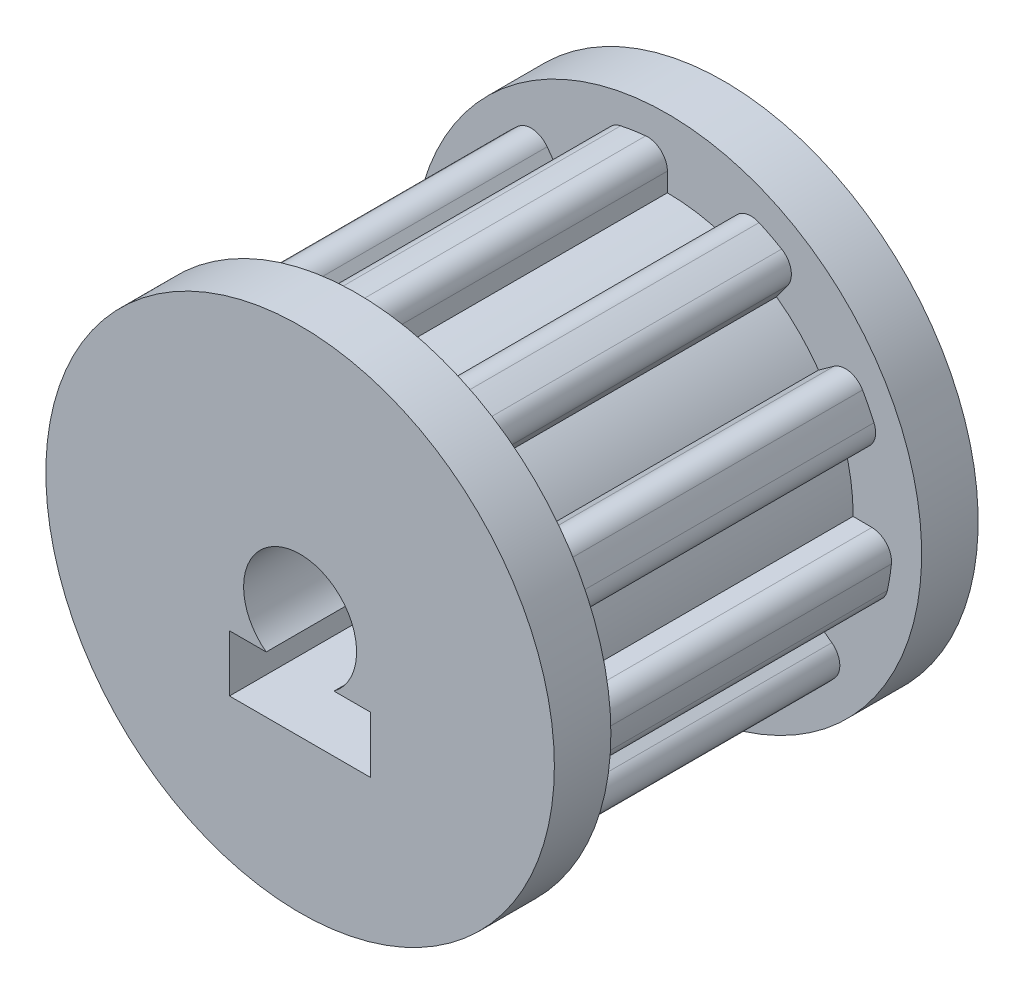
from build123d import *

# Parameters (mm, degrees)
BOSS_EXTRU_2_DEPTH                 = 11
CONG_1_R                           = 0.7
ESQUISSE2_R                        = 6.573611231
BOSS_EXTRU_3_DEPTH                 = 11
R_P_TITION_CIRCULAIRE1_COUNT       = 10
CONG_1_OF_R_P_TITION_CIRCULAIRE1_R = 0.7
ESQUISSE3_R                        = 9
BOSS_EXTRU_4_DEPTH                 = 2
BOSS_EXTRU_6_START                 = 2
ESQUISSE6_R                        = 9
BOSS_EXTRU_6_DEPTH                 = 2
ESQUISSE5_R                        = 2
ENL_V_MAT_EXTRU_1_DEPTH            = 20.672315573
ESQUISSE7_W                        = 5
ESQUISSE7_H                        = 2
ENL_V_MAT_EXTRU_2_DEPTH            = 6


with BuildPart() as part:
    # Esquisse1 → Boss.-Extru.2 (new body)
    with BuildSketch(Plane.XY):
        with BuildLine():
            Line((-2.39771114, 7.60456819), (-1.976723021, 6.269364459))
            ThreePointArc((-1.976723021, 6.269364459), (-1, 6.497104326), (0, 6.573611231))
            Line((0, 6.573611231), (0, 7.973611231))
            ThreePointArc((0, 7.973611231), (-1.212972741, 7.88081044), (-2.39771114, 7.60456819))
        make_face()
    boss_extru_2 = extrude(amount=BOSS_EXTRU_2_DEPTH)

    # Cong_1
    cong_1_edges = [part.edges().sort_by_distance(p)[0] for p in [
        (-2.39771114, 7.60456819, 5.5),
        (0, 7.973611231, 5.5),
    ]]
    fillet(cong_1_edges, radius=CONG_1_R)

    # Esquisse2 → Boss.-Extru.3 (add)
    with BuildSketch(Plane(origin=(0, 0, 0), x_dir=(-1, 0, 0), z_dir=(0, 0, -1))):
        Circle(ESQUISSE2_R)
    extrude(amount=-BOSS_EXTRU_3_DEPTH)

    # R_p_tition circulaire1: Boss.-Extru.2 ×10 about axis
    r_p_tition_circulaire1_axis = Axis((0, 0, 0), (0, 0, 1))
    for i in range(1, R_P_TITION_CIRCULAIRE1_COUNT):
        add(boss_extru_2.rotate(r_p_tition_circulaire1_axis, i * 360 / R_P_TITION_CIRCULAIRE1_COUNT))

    # Cong_1 of R_p_tition circulaire1
    cong_1_of_r_p_tition_circulaire1_edges = [part.edges().sort_by_distance(p)[0] for p in [
        (-6.409642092, 4.742885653, 5.5),
        (-4.686771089, 6.450786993, 5.5),
        (-7.973307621, 0.069582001, 5.5),
        (-7.58335492, 2.463981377, 5.5),
        (-6.491440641, -4.63029961, 5.5),
        (-7.58335492, -2.463981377, 5.5),
        (-2.530063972, -7.561564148, 5.5),
        (-4.686771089, -6.450786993, 5.5),
        (2.39771114, -7.60456819, 5.5),
        (0, -7.973611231, 5.5),
        (6.409642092, -4.742885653, 5.5),
        (4.686771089, -6.450786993, 5.5),
        (7.973307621, -0.069582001, 5.5),
        (7.58335492, -2.463981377, 5.5),
        (6.491440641, 4.63029961, 5.5),
        (7.58335492, 2.463981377, 5.5),
        (2.530063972, 7.561564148, 5.5),
        (4.686771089, 6.450786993, 5.5),
    ]]
    fillet(cong_1_of_r_p_tition_circulaire1_edges, radius=CONG_1_OF_R_P_TITION_CIRCULAIRE1_R)

    # Esquisse3 → Boss.-Extru.4 (add)
    with BuildSketch(Plane(origin=(0, 0, 0), x_dir=(-1, 0, 0), z_dir=(0, 0, -1))):
        Circle(ESQUISSE3_R)
    extrude(amount=BOSS_EXTRU_4_DEPTH)

    # Esquisse6 → Boss.-Extru.6 (add)
    with BuildSketch(Plane.XY.offset(11).offset(BOSS_EXTRU_6_START)):
        with Locations(Location((0, 0, 0), (0, 0, 180))):
            Circle(ESQUISSE6_R)
    extrude(amount=-BOSS_EXTRU_6_DEPTH)

    # Esquisse5 → Enl_v. mat.-Extru.1 (cut, through all)
    with BuildSketch(Plane(origin=(0, 0, -2), x_dir=(-1, 0, 0), z_dir=(0, 0, -1))):
        Circle(ESQUISSE5_R)
    extrude(amount=-ENL_V_MAT_EXTRU_1_DEPTH, mode=Mode.SUBTRACT)

    # Esquisse7 → Enl_v. mat.-Extru.2 (cut)
    with BuildSketch(Plane.XY.offset(13)):
        with Locations((0, -2.6)):
            Rectangle(ESQUISSE7_W, ESQUISSE7_H)
    extrude(amount=-ENL_V_MAT_EXTRU_2_DEPTH, mode=Mode.SUBTRACT)


solid = part.part
